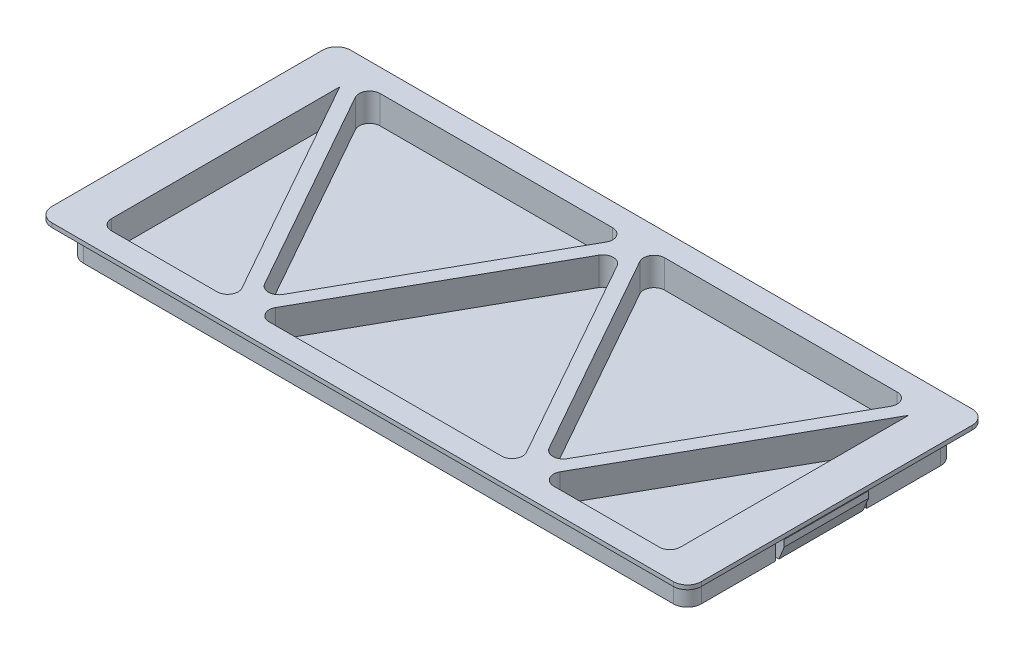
from build123d import *

# Parameters (mm, degrees)
SKETCH1_W           = 88.1
SKETCH1_H           = 38.1
BOSS_EXTRUDE1_DEPTH = 5
SHELL1_T            = -1
SKETCH2_W           = 92.6
SKETCH2_H           = 42.6
SKETCH2_W_2         = 88.1
SKETCH2_H_2         = 38.1
BOSS_EXTRUDE2_DEPTH = 0.6
SKETCH5_W           = 3.5
SKETCH5_H           = 38.1
BOSS_EXTRUDE4_DEPTH = 5
SKETCH7_W           = 1.5
SKETCH7_H           = 13
CUT_EXTRUDE2_DEPTH  = 3.9
SKETCH8_W           = 0.5
SKETCH8_H           = 12
BOSS_EXTRUDE5_DEPTH = 3.9
BOSS_EXTRUDE6_DEPTH = 12
BOSS_EXTRUDE3_DEPTH = 4
SKETCH4_W           = 88.1
SKETCH4_H           = 100
CUT_EXTRUDE1_DEPTH  = 4.4
FILLET1_R           = 2
FILLET2_R           = 1.5


with BuildPart() as part:
    # Sketch1 → Boss-Extrude1 (new body)
    with BuildSketch(Plane(origin=(0, 0, 0), x_dir=(1, 0, 0), z_dir=(0, 1, 0))):
        Rectangle(SKETCH1_W, SKETCH1_H)
    extrude(amount=BOSS_EXTRUDE1_DEPTH)

    # Shell1
    shell1_openings = [part.faces().sort_by_distance(p)[0] for p in [
        (0, 5, 0),
    ]]
    offset(amount=SHELL1_T, openings=shell1_openings, kind=Kind.INTERSECTION)

    # Sketch2 → Boss-Extrude2 (add)
    with BuildSketch(Plane(origin=(0, 5, 0), x_dir=(1, 0, 0), z_dir=(0, 1, 0))):
        Rectangle(SKETCH2_W, SKETCH2_H)
        Rectangle(SKETCH2_W_2, SKETCH2_H_2, mode=Mode.SUBTRACT)
    extrude(amount=-BOSS_EXTRUDE2_DEPTH)

    # Sketch5 → Boss-Extrude4 (add)
    with BuildSketch(Plane.XZ):
        with Locations((42.3, 0)):
            Rectangle(SKETCH5_W, SKETCH5_H)
    boss_extrude4 = extrude(amount=-BOSS_EXTRUDE4_DEPTH)

    # Sketch7 → Cut-Extrude2 (cut)
    with BuildSketch(Plane.XZ):
        with Locations((43.3, 0)):
            Rectangle(SKETCH7_W, SKETCH7_H)
    cut_extrude2 = extrude(amount=-CUT_EXTRUDE2_DEPTH, mode=Mode.SUBTRACT)

    # Sketch8 → Boss-Extrude5 (add)
    with BuildSketch(Plane.XZ.offset(-3.9)):
        with Locations((43.8, 0)):
            Rectangle(SKETCH8_W, SKETCH8_H)
    boss_extrude5 = extrude(amount=BOSS_EXTRUDE5_DEPTH)

    # Sketch9 → Boss-Extrude6 (add)
    with BuildSketch(Plane(origin=(0, 0, -6), x_dir=(-1, 0, 0), z_dir=(0, 0, -1))):
        Polygon((-44.05, 0), (-44.8, 1.85631514), (-44.8, 2.8), (-44.05, 2.8), align=None)
    boss_extrude6 = extrude(amount=-BOSS_EXTRUDE6_DEPTH)

    # Mirror1: Boss-Extrude4, Cut-Extrude2, Boss-Extrude5, Boss-Extrude6 across plane
    add(boss_extrude4.mirror(Plane(origin=(0, 0, 0), x_dir=(0, 0, 1), z_dir=(1, 0, 0))))
    add(cut_extrude2.mirror(Plane(origin=(0, 0, 0), x_dir=(0, 0, 1), z_dir=(1, 0, 0))), mode=Mode.SUBTRACT)
    add(boss_extrude5.mirror(Plane(origin=(0, 0, 0), x_dir=(0, 0, 1), z_dir=(1, 0, 0))))
    add(boss_extrude6.mirror(Plane(origin=(0, 0, 0), x_dir=(0, 0, 1), z_dir=(1, 0, 0))))

    # Sketch3 → Boss-Extrude3 (add)
    with BuildSketch(Plane(origin=(0, 5, 0), x_dir=(1, 0, 0), z_dir=(0, 1, 0))):
        Polygon((-41.421897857, 17.560312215), (-20.275, -20.092117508), (0, 16.007882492), (20.275, -20.092117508), (41.421897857, 17.560312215), (39.678102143, 18.539687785), (20.275, -16.007882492), (0, 20.092117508), (-20.275, -16.007882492), (-39.678102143, 18.539687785), align=None)
    extrude(amount=-BOSS_EXTRUDE3_DEPTH)

    # Sketch4 → Cut-Extrude1 (cut)
    with BuildSketch(Plane.XZ):
        with Locations((0, 69.05)):
            Rectangle(SKETCH4_W, SKETCH4_H)
        with Locations((0, -69.05)):
            Rectangle(SKETCH4_W, SKETCH4_H)
    extrude(amount=-CUT_EXTRUDE1_DEPTH, mode=Mode.SUBTRACT)

    # Fillet1
    fillet1_edges = [part.edges().sort_by_distance(p)[0] for p in [
        (-44.05, 2.2, -19.05),
        (44.05, 2.2, -19.05),
        (44.05, 2.2, 19.05),
        (-44.05, 2.2, 19.05),
        (-46.3, 4.7, -21.3),
        (46.3, 4.7, -21.3),
        (46.3, 4.7, 21.3),
        (-46.3, 4.7, 21.3),
    ]]
    fillet(fillet1_edges, radius=FILLET1_R)

    # Fillet2
    fillet2_edges = [part.edges().sort_by_distance(p)[0] for p in [
        (-40.55, 3, 18.05),
        (-21.421923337, 3, 18.05),
        (-39.403076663, 3, -18.05),
        (-1.146923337, 3, -18.05),
        (-20.275, 3, 16.007882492),
        (1.146923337, 3, -18.05),
        (39.403076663, 3, -18.05),
        (20.275, 3, 16.007882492),
        (21.421923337, 3, 18.05),
        (19.128076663, 3, 18.05),
        (-19.128076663, 3, 18.05),
        (0, 3, -16.007882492),
        (40.55, 3, 18.05),
    ]]
    fillet(fillet2_edges, radius=FILLET2_R)


solid = part.part
